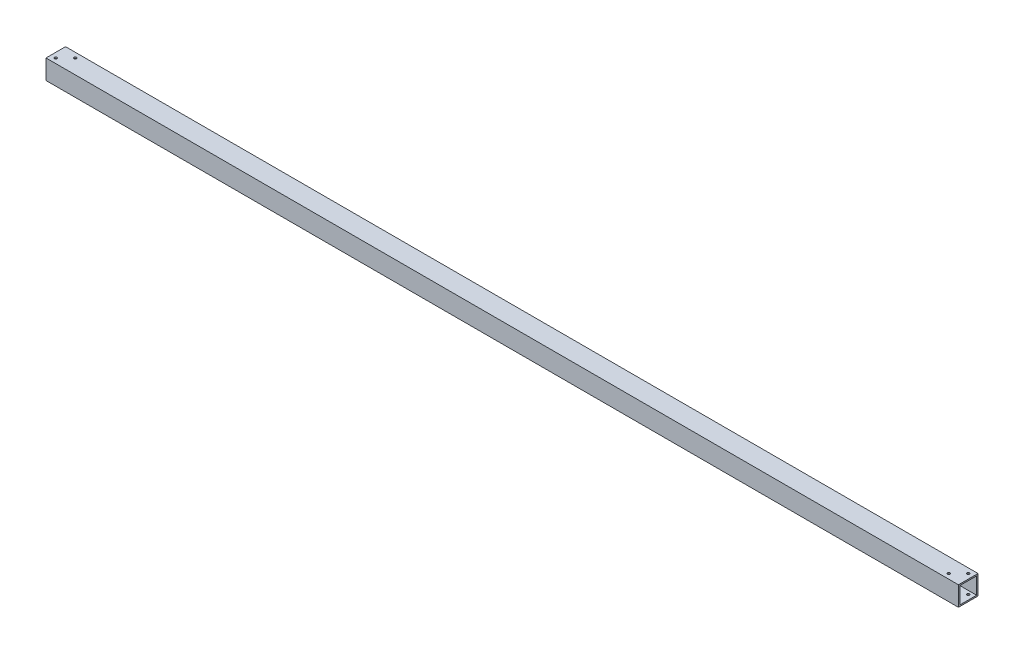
from build123d import *

# Parameters (mm, degrees)
SKETCH1_W          = 50.8
SKETCH1_H          = 50.8
SKETCH1_W_2        = 43.4848
SKETCH1_H_2        = 43.4848
EXTRUDE1_DEPTH     = 2370.582
SKETCH3_R          = 3.37312
CUT_EXTRUDE1_DEPTH = 2372.670360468


with BuildPart() as part:
    # Sketch1 → Extrude1 (new body)
    with BuildSketch(Plane(origin=(0, 0, 0), x_dir=(0, 0, -1), z_dir=(1, 0, 0))):
        with Locations((25.4, 25.4)):
            Rectangle(SKETCH1_W, SKETCH1_H)
        with Locations((25.4, 25.4)):
            Rectangle(SKETCH1_W_2, SKETCH1_H_2, mode=Mode.SUBTRACT)
    extrude(amount=EXTRUDE1_DEPTH)

    # Sketch3 → Cut-Extrude1 (cut, through all)
    with BuildSketch(Plane(origin=(0, 50.8, 0), x_dir=(1, 0, 0), z_dir=(0, 1, 0))):
        with Locations(Location((12.7, 12.7, 0), (0, 0, 270))):
            Circle(SKETCH3_R)
        with Locations(Location((38.1, 38.1, 0), (0, 0, 270))):
            Circle(SKETCH3_R)
        with Locations(Location((2357.882, 38.1, 0), (0, 0, 270))):
            Circle(SKETCH3_R)
        with Locations(Location((2332.482, 12.7, 0), (0, 0, 270))):
            Circle(SKETCH3_R)
    extrude(amount=-CUT_EXTRUDE1_DEPTH, mode=Mode.SUBTRACT)


solid = part.part
